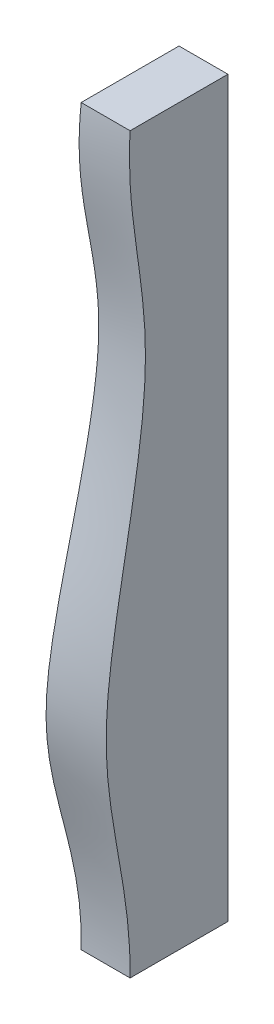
ISO-10303-21;
HEADER;
FILE_DESCRIPTION(('STEP AP214'),'2;1');
FILE_NAME('part.step','',(''),(''),'','','');
FILE_SCHEMA(('AUTOMOTIVE_DESIGN { 1 0 10303 214 1 1 1 1 }'));
ENDSEC;
DATA;
#1=APPLICATION_CONTEXT('core data for automotive mechanical design processes');
#2=APPLICATION_PROTOCOL_DEFINITION('international standard','automotive_design',2000,#1);
#3=PRODUCT_CONTEXT('',#1,'mechanical');
#4=PRODUCT('Part','Part','',(#3));
#5=PRODUCT_RELATED_PRODUCT_CATEGORY('part','',(#4));
#6=PRODUCT_DEFINITION_FORMATION('','',#4);
#7=PRODUCT_DEFINITION_CONTEXT('part definition',#1,'design');
#8=PRODUCT_DEFINITION('design','',#6,#7);
#9=PRODUCT_DEFINITION_SHAPE('','',#8);
#10=(LENGTH_UNIT() NAMED_UNIT(*) SI_UNIT(.MILLI.,.METRE.));
#11=(NAMED_UNIT(*) PLANE_ANGLE_UNIT() SI_UNIT($,.RADIAN.));
#12=(NAMED_UNIT(*) SI_UNIT($,.STERADIAN.) SOLID_ANGLE_UNIT());
#13=UNCERTAINTY_MEASURE_WITH_UNIT(LENGTH_MEASURE(1.E-05),#10,'distance_accuracy_value','');
#14=(GEOMETRIC_REPRESENTATION_CONTEXT(3) GLOBAL_UNCERTAINTY_ASSIGNED_CONTEXT((#13)) GLOBAL_UNIT_ASSIGNED_CONTEXT((#10,
#11,#12)) REPRESENTATION_CONTEXT('',''));
#15=CARTESIAN_POINT('',(0.,0.,0.));
#16=DIRECTION('',(0.,0.,1.));
#17=DIRECTION('',(1.,0.,0.));
#18=AXIS2_PLACEMENT_3D('',#15,#16,#17);
#19=CARTESIAN_POINT('',(650.,375.,253.120113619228));
#20=DIRECTION('',(1.,0.,0.));
#21=DIRECTION('',(0.,0.,-1.));
#22=AXIS2_PLACEMENT_3D('',#19,#20,#21);
#23=PLANE('',#22);
#24=CARTESIAN_POINT('',(650.,375.,100.));
#25=CARTESIAN_POINT('',(650.,373.529887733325,100.089583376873));
#26=CARTESIAN_POINT('',(650.,372.059231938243,100.170200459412));
#27=CARTESIAN_POINT('',(650.,369.117059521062,100.313644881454));
#28=CARTESIAN_POINT('',(650.,367.645542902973,100.376472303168));
#29=CARTESIAN_POINT('',(650.,364.704940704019,100.484368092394));
#30=CARTESIAN_POINT('',(650.,363.235856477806,100.529473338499));
#31=CARTESIAN_POINT('',(650.,360.2972640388,100.602322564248));
#32=CARTESIAN_POINT('',(650.,358.827755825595,100.630066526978));
#33=CARTESIAN_POINT('',(650.,354.423278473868,100.687567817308));
#34=CARTESIAN_POINT('',(650.,351.487937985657,100.691755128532));
#35=CARTESIAN_POINT('',(650.,345.620681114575,100.634585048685));
#36=CARTESIAN_POINT('',(650.,342.688764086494,100.573288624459));
#37=CARTESIAN_POINT('',(650.,336.828206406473,100.388873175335));
#38=CARTESIAN_POINT('',(650.,333.899564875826,100.265781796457));
#39=CARTESIAN_POINT('',(650.,328.045452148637,99.9622336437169));
#40=CARTESIAN_POINT('',(650.,325.11998078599,99.7817800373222));
#41=CARTESIAN_POINT('',(650.,319.263640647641,99.3681176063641));
#42=CARTESIAN_POINT('',(650.,316.332783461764,99.1347461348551));
#43=CARTESIAN_POINT('',(650.,310.474284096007,98.6215532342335));
#44=CARTESIAN_POINT('',(650.,307.546643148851,98.3417178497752));
#45=CARTESIAN_POINT('',(650.,301.694438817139,97.74228273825));
#46=CARTESIAN_POINT('',(650.,298.769876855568,97.4226692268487));
#47=CARTESIAN_POINT('',(650.,292.92362331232,96.7509641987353));
#48=CARTESIAN_POINT('',(650.,290.001932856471,96.3988629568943));
#49=CARTESIAN_POINT('',(650.,284.161156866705,95.6699647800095));
#50=CARTESIAN_POINT('',(650.,281.242071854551,95.2931636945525));
#51=CARTESIAN_POINT('',(650.,275.406197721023,94.5230185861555));
#52=CARTESIAN_POINT('',(650.,272.489408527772,94.1296751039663));
#53=CARTESIAN_POINT('',(650.,266.67410172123,93.3370505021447));
#54=CARTESIAN_POINT('',(650.,263.775577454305,92.937817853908));
#55=CARTESIAN_POINT('',(650.,257.979159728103,92.1394687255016));
#56=CARTESIAN_POINT('',(650.,255.081266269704,91.7403522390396));
#57=CARTESIAN_POINT('',(650.,249.284838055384,90.9503637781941));
#58=CARTESIAN_POINT('',(650.,246.386303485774,90.5594904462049));
#59=CARTESIAN_POINT('',(650.,240.587344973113,89.7939371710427));
#60=CARTESIAN_POINT('',(650.,237.68692122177,89.4192557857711));
#61=CARTESIAN_POINT('',(650.,231.882975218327,88.6937461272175));
#62=CARTESIAN_POINT('',(650.,228.979452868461,88.3429186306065));
#63=CARTESIAN_POINT('',(650.,223.168151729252,87.6723910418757));
#64=CARTESIAN_POINT('',(650.,220.260372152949,87.3526977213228));
#65=CARTESIAN_POINT('',(650.,214.454247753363,86.7527745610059));
#66=CARTESIAN_POINT('',(650.,211.555921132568,86.4723697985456));
#67=CARTESIAN_POINT('',(650.,205.754719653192,85.9554568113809));
#68=CARTESIAN_POINT('',(650.,202.851843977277,85.7189576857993));
#69=CARTESIAN_POINT('',(650.,197.042529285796,85.2955327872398));
#70=CARTESIAN_POINT('',(650.,194.136090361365,85.1086057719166));
#71=CARTESIAN_POINT('',(650.,188.320636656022,84.7892653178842));
#72=CARTESIAN_POINT('',(650.,185.41162236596,84.6568430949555));
#73=CARTESIAN_POINT('',(650.,181.046879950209,84.5022034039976));
#74=CARTESIAN_POINT('',(650.,179.59190635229,84.457991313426));
#75=CARTESIAN_POINT('',(650.,176.681571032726,84.3846652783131));
#76=CARTESIAN_POINT('',(650.,175.226209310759,84.3555513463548));
#77=CARTESIAN_POINT('',(650.,172.315529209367,84.31283446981));
#78=CARTESIAN_POINT('',(650.,170.86021087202,84.2992286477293));
#79=CARTESIAN_POINT('',(650.,167.949510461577,84.2878807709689));
#80=CARTESIAN_POINT('',(650.,166.494128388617,84.2901386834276));
#81=CARTESIAN_POINT('',(650.,164.308571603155,84.3056671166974));
#82=CARTESIAN_POINT('',(650.,163.578349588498,84.3128903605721));
#83=CARTESIAN_POINT('',(650.,162.117957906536,84.331456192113));
#84=CARTESIAN_POINT('',(650.,161.387788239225,84.3427987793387));
#85=CARTESIAN_POINT('',(650.,159.197389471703,84.3828568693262));
#86=CARTESIAN_POINT('',(650.,157.737267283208,84.4176027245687));
#87=CARTESIAN_POINT('',(650.,154.817275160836,84.5021741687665));
#88=CARTESIAN_POINT('',(650.,153.357405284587,84.5520017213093));
#89=CARTESIAN_POINT('',(650.,150.43822333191,84.6658338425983));
#90=CARTESIAN_POINT('',(650.,148.978911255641,84.7298384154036));
#91=CARTESIAN_POINT('',(650.,144.601257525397,84.9418621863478));
#92=CARTESIAN_POINT('',(650.,141.683868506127,85.1098712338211));
#93=CARTESIAN_POINT('',(650.,135.851597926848,85.4931062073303));
#94=CARTESIAN_POINT('',(650.,132.936717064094,85.7083425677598));
#95=CARTESIAN_POINT('',(650.,127.110055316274,86.1807244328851));
#96=CARTESIAN_POINT('',(650.,124.198274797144,86.437874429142));
#97=CARTESIAN_POINT('',(650.,118.378515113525,86.9898248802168));
#98=CARTESIAN_POINT('',(650.,115.470535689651,87.284622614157));
#99=CARTESIAN_POINT('',(650.,109.647268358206,87.9092447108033));
#100=CARTESIAN_POINT('',(650.,106.731994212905,88.2391968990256));
#101=CARTESIAN_POINT('',(650.,100.905713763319,88.9296286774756));
#102=CARTESIAN_POINT('',(650.,97.9947066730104,89.2901016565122));
#103=CARTESIAN_POINT('',(650.,92.176583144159,90.038377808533));
#104=CARTESIAN_POINT('',(650.,89.269466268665,90.4261775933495));
#105=CARTESIAN_POINT('',(650.,83.4587801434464,91.226152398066));
#106=CARTESIAN_POINT('',(650.,80.55521068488,91.6383259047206));
#107=CARTESIAN_POINT('',(650.,74.7513026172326,92.4842869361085));
#108=CARTESIAN_POINT('',(650.,71.8509639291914,92.9180739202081));
#109=CARTESIAN_POINT('',(650.,66.0532253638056,93.8046613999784));
#110=CARTESIAN_POINT('',(650.,63.1558254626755,94.2574617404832));
#111=CARTESIAN_POINT('',(650.,54.5077571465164,95.6342445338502));
#112=CARTESIAN_POINT('',(650.,48.7609601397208,96.5825497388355));
#113=CARTESIAN_POINT('',(650.,37.275086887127,98.5259583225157));
#114=CARTESIAN_POINT('',(650.,31.5360110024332,99.5210638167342));
#115=CARTESIAN_POINT('',(650.,20.0628145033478,101.540469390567));
#116=CARTESIAN_POINT('',(650.,14.3286940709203,102.564770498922));
#117=CARTESIAN_POINT('',(650.,2.86034169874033,104.625342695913));
#118=CARTESIAN_POINT('',(650.,-2.87388943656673,105.661618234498));
#119=CARTESIAN_POINT('',(650.,-11.4760455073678,107.210940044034));
#120=CARTESIAN_POINT('',(650.,-14.3435123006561,107.726522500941));
#121=CARTESIAN_POINT('',(650.,-20.0791832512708,108.753566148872));
#122=CARTESIAN_POINT('',(650.,-22.9473874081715,109.265027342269));
#123=CARTESIAN_POINT('',(650.,-28.6848609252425,110.281284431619));
#124=CARTESIAN_POINT('',(650.,-31.5541302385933,110.786080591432));
#125=CARTESIAN_POINT('',(650.,-37.2942906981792,111.786357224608));
#126=CARTESIAN_POINT('',(650.,-40.165181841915,112.281837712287));
#127=CARTESIAN_POINT('',(650.,-45.9222919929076,113.262903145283));
#128=CARTESIAN_POINT('',(650.,-48.8085205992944,113.748431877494));
#129=CARTESIAN_POINT('',(650.,-54.583527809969,114.704139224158));
#130=CARTESIAN_POINT('',(650.,-57.4723064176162,115.174317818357));
#131=CARTESIAN_POINT('',(650.,-63.252915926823,116.096008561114));
#132=CARTESIAN_POINT('',(650.,-66.1447468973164,116.547520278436));
#133=CARTESIAN_POINT('',(650.,-71.9320052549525,117.42828774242));
#134=CARTESIAN_POINT('',(650.,-74.8274328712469,117.857541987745));
#135=CARTESIAN_POINT('',(650.,-80.622477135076,118.68988810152));
#136=CARTESIAN_POINT('',(650.,-83.5220943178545,119.092976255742));
#137=CARTESIAN_POINT('',(650.,-89.326167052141,119.868717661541));
#138=CARTESIAN_POINT('',(650.,-92.2306236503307,120.241363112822));
#139=CARTESIAN_POINT('',(650.,-98.029737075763,120.949648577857));
#140=CARTESIAN_POINT('',(650.,-100.92437291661,121.285459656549));
#141=CARTESIAN_POINT('',(650.,-106.718288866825,121.917044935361));
#142=CARTESIAN_POINT('',(650.,-109.617569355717,122.212815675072));
#143=CARTESIAN_POINT('',(650.,-115.420074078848,122.758605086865));
#144=CARTESIAN_POINT('',(650.,-118.323297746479,123.008629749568));
#145=CARTESIAN_POINT('',(650.,-124.133069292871,123.456718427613));
#146=CARTESIAN_POINT('',(650.,-127.039616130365,123.654795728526));
#147=CARTESIAN_POINT('',(650.,-131.401591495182,123.907862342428));
#148=CARTESIAN_POINT('',(650.,-132.855761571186,123.984869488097));
#149=CARTESIAN_POINT('',(650.,-135.764850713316,124.123300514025));
#150=CARTESIAN_POINT('',(650.,-137.21976977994,124.184724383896));
#151=CARTESIAN_POINT('',(650.,-140.130053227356,124.29103334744));
#152=CARTESIAN_POINT('',(650.,-141.585417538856,124.335920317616));
#153=CARTESIAN_POINT('',(650.,-143.768782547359,124.390121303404));
#154=CARTESIAN_POINT('',(650.,-144.49662440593,124.406000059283));
#155=CARTESIAN_POINT('',(650.,-145.952392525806,124.433238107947));
#156=CARTESIAN_POINT('',(650.,-146.680318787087,124.444597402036));
#157=CARTESIAN_POINT('',(650.,-148.722769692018,124.470097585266));
#158=CARTESIAN_POINT('',(650.,-150.037362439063,124.479105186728));
#159=CARTESIAN_POINT('',(650.,-152.666558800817,124.482511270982));
#160=CARTESIAN_POINT('',(650.,-153.981162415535,124.476909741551));
#161=CARTESIAN_POINT('',(650.,-157.925284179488,124.438498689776));
#162=CARTESIAN_POINT('',(650.,-160.554622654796,124.384076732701));
#163=CARTESIAN_POINT('',(650.,-165.812021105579,124.219768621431));
#164=CARTESIAN_POINT('',(650.,-168.44008074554,124.109871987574));
#165=CARTESIAN_POINT('',(650.,-173.69376732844,123.837206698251));
#166=CARTESIAN_POINT('',(650.,-176.319393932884,123.674431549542));
#167=CARTESIAN_POINT('',(650.,-181.56704928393,123.299208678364));
#168=CARTESIAN_POINT('',(650.,-184.189078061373,123.086761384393));
#169=CARTESIAN_POINT('',(650.,-189.428412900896,122.615943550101));
#170=CARTESIAN_POINT('',(650.,-192.045719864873,122.357582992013));
#171=CARTESIAN_POINT('',(650.,-197.293175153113,121.797208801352));
#172=CARTESIAN_POINT('',(650.,-199.923293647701,121.494917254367));
#173=CARTESIAN_POINT('',(650.,-205.178415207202,120.852666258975));
#174=CARTESIAN_POINT('',(650.,-207.803419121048,120.512713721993));
#175=CARTESIAN_POINT('',(650.,-213.048967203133,119.800048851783));
#176=CARTESIAN_POINT('',(650.,-215.669511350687,119.427336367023));
#177=CARTESIAN_POINT('',(650.,-220.90683347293,118.654311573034));
#178=CARTESIAN_POINT('',(650.,-223.52361094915,118.25399590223));
#179=CARTESIAN_POINT('',(650.,-228.754122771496,117.431119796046));
#180=CARTESIAN_POINT('',(650.,-231.367856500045,117.008555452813));
#181=CARTESIAN_POINT('',(650.,-236.593024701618,116.146671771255));
#182=CARTESIAN_POINT('',(650.,-239.204458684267,115.70734947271));
#183=CARTESIAN_POINT('',(650.,-245.511338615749,114.632512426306));
#184=CARTESIAN_POINT('',(650.,-249.205827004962,113.991406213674));
#185=CARTESIAN_POINT('',(650.,-256.593667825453,112.702626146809));
#186=CARTESIAN_POINT('',(650.,-260.287020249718,112.054952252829));
#187=CARTESIAN_POINT('',(650.,-267.67459186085,110.768628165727));
#188=CARTESIAN_POINT('',(650.,-271.368810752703,110.129976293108));
#189=CARTESIAN_POINT('',(650.,-278.760019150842,108.876745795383));
#190=CARTESIAN_POINT('',(650.,-282.457007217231,108.262158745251));
#191=CARTESIAN_POINT('',(650.,-289.855525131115,107.071327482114));
#192=CARTESIAN_POINT('',(650.,-293.557052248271,106.495066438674));
#193=CARTESIAN_POINT('',(650.,-300.966254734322,105.394189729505));
#194=CARTESIAN_POINT('',(650.,-304.673926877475,104.869552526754));
#195=CARTESIAN_POINT('',(650.,-312.05732030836,103.88936722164));
#196=CARTESIAN_POINT('',(650.,-315.732949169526,103.433128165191));
#197=CARTESIAN_POINT('',(650.,-323.092706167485,102.593819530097));
#198=CARTESIAN_POINT('',(650.,-326.776834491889,102.210751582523));
#199=CARTESIAN_POINT('',(650.,-334.154883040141,101.527239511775));
#200=CARTESIAN_POINT('',(650.,-337.848807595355,101.226841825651));
#201=CARTESIAN_POINT('',(650.,-345.247748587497,100.716978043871));
#202=CARTESIAN_POINT('',(650.,-348.952773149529,100.50762772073));
#203=CARTESIAN_POINT('',(650.,-354.517379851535,100.267256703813));
#204=CARTESIAN_POINT('',(650.,-356.375424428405,100.199375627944));
#205=CARTESIAN_POINT('',(650.,-360.092276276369,100.089047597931));
#206=CARTESIAN_POINT('',(650.,-361.95108354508,100.046600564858));
#207=CARTESIAN_POINT('',(650.,-365.67490284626,99.9877114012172));
#208=CARTESIAN_POINT('',(650.,-367.539916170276,99.9713506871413));
#209=CARTESIAN_POINT('',(650.,-371.270008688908,99.9654344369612));
#210=CARTESIAN_POINT('',(650.,-373.135087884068,99.9758792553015));
#211=CARTESIAN_POINT('',(650.,-375.,100.));
#212=B_SPLINE_CURVE_WITH_KNOTS('',3,(#24,#25,#26,#27,#28,#29,#30,#31,#32,#33,#34,#35,#36,#37,
#38,#39,#40,#41,#42,#43,#44,#45,#46,#47,#48,#49,#50,#51,#52,#53,#54,#55,#56,#57,#58,#59,#60,#61,
#62,#63,#64,#65,#66,#67,#68,#69,#70,#71,#72,#73,#74,#75,#76,#77,#78,#79,#80,#81,#82,#83,#84,#85,
#86,#87,#88,#89,#90,#91,#92,#93,#94,#95,#96,#97,#98,#99,#100,#101,#102,#103,#104,#105,#106,#107,
#108,#109,#110,#111,#112,#113,#114,#115,#116,#117,#118,#119,#120,#121,#122,#123,#124,#125,#126,
#127,#128,#129,#130,#131,#132,#133,#134,#135,#136,#137,#138,#139,#140,#141,#142,#143,#144,#145,
#146,#147,#148,#149,#150,#151,#152,#153,#154,#155,#156,#157,#158,#159,#160,#161,#162,#163,#164,
#165,#166,#167,#168,#169,#170,#171,#172,#173,#174,#175,#176,#177,#178,#179,#180,#181,#182,#183,
#184,#185,#186,#187,#188,#189,#190,#191,#192,#193,#194,#195,#196,#197,#198,#199,#200,#201,#202,
#203,#204,#205,#206,#207,#208,#209,#210,#211),.UNSPECIFIED.,.F.,.F.,(4,2,2,2,2,2,2,2,2,2,2,2,2,
2,2,2,2,2,2,2,2,2,2,2,2,2,2,2,2,2,2,2,2,2,2,2,2,2,2,2,2,2,2,2,2,2,2,2,2,2,2,2,2,2,2,2,2,2,2,2,2,
2,2,2,2,2,2,2,2,2,2,2,2,2,2,2,2,2,2,2,2,2,2,2,2,2,2,2,2,2,2,2,2,4),(0.,4.41848557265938,
8.83695072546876,13.2461720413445,17.6553976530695,26.4605874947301,35.2575866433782,
44.0506536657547,52.8432352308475,61.6632168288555,70.4858522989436,79.3115536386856,
88.1399055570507,96.9697447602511,105.799295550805,114.576963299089,123.352708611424,
132.126997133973,140.900502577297,149.674293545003,158.449988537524,167.185277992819,
175.922375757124,184.659254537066,193.394724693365,197.76159560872,202.128470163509,
206.494534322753,210.860589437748,213.051352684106,215.242115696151,219.623631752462,
224.005718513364,228.387806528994,237.153993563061,245.922119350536,254.691185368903,
263.459617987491,272.261098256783,281.060676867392,289.85916635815,298.65711016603,
307.454834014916,316.252486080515,333.725710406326,351.199725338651,368.674356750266,
386.155705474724,394.896053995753,403.63639748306,412.376393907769,421.116376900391,
429.896690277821,438.67701523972,447.457542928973,456.238662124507,465.021025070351,
473.805631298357,482.547539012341,491.290201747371,500.031718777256,508.770997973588,
513.139551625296,517.50810818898,521.876168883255,524.060201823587,526.244234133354,
530.188012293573,534.131793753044,542.020828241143,549.911353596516,557.802848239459,
565.694274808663,573.583987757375,581.525980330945,589.466517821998,597.407092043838,
605.348634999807,613.291577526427,621.235929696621,632.485002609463,643.734143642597,
654.98116223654,666.224207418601,677.462282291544,688.695648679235,699.806529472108,
710.917657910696,722.035014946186,733.166467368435,738.744175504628,744.321866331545,
749.916931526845,755.512070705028),.UNSPECIFIED.);
#213=CARTESIAN_POINT('',(650.,375.,100.));
#214=VERTEX_POINT('',#213);
#215=CARTESIAN_POINT('',(650.,-375.,100.));
#216=VERTEX_POINT('',#215);
#217=EDGE_CURVE('E161',#214,#216,#212,.T.);
#218=ORIENTED_EDGE('',*,*,#217,.T.);
#219=DIRECTION('',(0.,0.,-1.));
#220=VECTOR('',#219,1.);
#221=CARTESIAN_POINT('',(650.,-375.,253.120113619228));
#222=LINE('',#221,#220);
#223=CARTESIAN_POINT('',(650.,-375.,0.));
#224=VERTEX_POINT('',#223);
#225=EDGE_CURVE('E162',#216,#224,#222,.T.);
#226=ORIENTED_EDGE('',*,*,#225,.T.);
#227=DIRECTION('',(0.,-1.,0.));
#228=VECTOR('',#227,1.);
#229=CARTESIAN_POINT('',(650.,375.,0.));
#230=LINE('',#229,#228);
#231=CARTESIAN_POINT('',(650.,375.,0.));
#232=VERTEX_POINT('',#231);
#233=EDGE_CURVE('E65',#232,#224,#230,.T.);
#234=ORIENTED_EDGE('',*,*,#233,.F.);
#235=DIRECTION('',(0.,0.,1.));
#236=VECTOR('',#235,1.);
#237=CARTESIAN_POINT('',(650.,375.,253.111113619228));
#238=LINE('',#237,#236);
#239=EDGE_CURVE('E51',#232,#214,#238,.T.);
#240=ORIENTED_EDGE('',*,*,#239,.T.);
#241=EDGE_LOOP('',(#218,#226,#234,#240));
#242=FACE_BOUND('',#241,.T.);
#243=ADVANCED_FACE('F35',(#242),#23,.T.);
#244=CARTESIAN_POINT('',(0.,0.,0.));
#245=DIRECTION('',(0.,0.,-1.));
#246=DIRECTION('',(-1.,0.,0.));
#247=AXIS2_PLACEMENT_3D('',#244,#245,#246);
#248=PLANE('',#247);
#249=DIRECTION('',(1.,0.,0.));
#250=VECTOR('',#249,1.);
#251=CARTESIAN_POINT('',(-750.,-375.,0.));
#252=LINE('',#251,#250);
#253=CARTESIAN_POINT('',(600.,-375.,0.));
#254=VERTEX_POINT('',#253);
#255=EDGE_CURVE('E95',#254,#224,#252,.T.);
#256=ORIENTED_EDGE('',*,*,#255,.F.);
#257=DIRECTION('',(0.,1.,0.));
#258=VECTOR('',#257,1.);
#259=CARTESIAN_POINT('',(600.,375.,0.));
#260=LINE('',#259,#258);
#261=CARTESIAN_POINT('',(600.,375.,0.));
#262=VERTEX_POINT('',#261);
#263=EDGE_CURVE('E82',#254,#262,#260,.T.);
#264=ORIENTED_EDGE('',*,*,#263,.T.);
#265=DIRECTION('',(-1.,0.,0.));
#266=VECTOR('',#265,1.);
#267=CARTESIAN_POINT('',(-750.,375.,0.));
#268=LINE('',#267,#266);
#269=EDGE_CURVE('E100',#232,#262,#268,.T.);
#270=ORIENTED_EDGE('',*,*,#269,.F.);
#271=ORIENTED_EDGE('',*,*,#233,.T.);
#272=EDGE_LOOP('',(#256,#264,#270,#271));
#273=FACE_BOUND('',#272,.T.);
#274=ADVANCED_FACE('F99',(#273),#248,.T.);
#275=CARTESIAN_POINT('',(750.,-375.,100.));
#276=CARTESIAN_POINT('',(750.,-302.078506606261,100.));
#277=CARTESIAN_POINT('',(750.,-224.483786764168,100.));
#278=CARTESIAN_POINT('',(750.,-61.5160152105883,100.));
#279=CARTESIAN_POINT('',(750.,39.4445673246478,100.));
#280=CARTESIAN_POINT('',(750.,211.849847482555,100.));
#281=CARTESIAN_POINT('',(750.,298.882075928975,100.));
#282=CARTESIAN_POINT('',(750.,375.,100.));
#283=CARTESIAN_POINT('',(669.085175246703,-375.,100.));
#284=CARTESIAN_POINT('',(669.085175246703,-302.078506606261,100.));
#285=CARTESIAN_POINT('',(669.085175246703,-234.282472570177,121.198481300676));
#286=CARTESIAN_POINT('',(669.085175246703,-62.2283080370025,120.288550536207));
#287=CARTESIAN_POINT('',(669.085175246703,68.0647781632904,82.7868169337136));
#288=CARTESIAN_POINT('',(669.085175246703,240.312514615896,73.0426687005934));
#289=CARTESIAN_POINT('',(669.085175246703,298.882075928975,100.));
#290=CARTESIAN_POINT('',(669.085175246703,375.,100.));
#291=CARTESIAN_POINT('',(500.445116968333,-375.,100.));
#292=CARTESIAN_POINT('',(517.991528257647,-284.627602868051,95.5040591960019));
#293=CARTESIAN_POINT('',(530.038001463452,-221.673003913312,150.719602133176));
#294=CARTESIAN_POINT('',(473.74510655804,-71.7416270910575,167.060530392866));
#295=CARTESIAN_POINT('',(387.213321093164,45.6135081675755,91.591323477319));
#296=CARTESIAN_POINT('',(378.694107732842,207.638743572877,66.6461848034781));
#297=CARTESIAN_POINT('',(433.17831170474,253.396603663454,122.492891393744));
#298=CARTESIAN_POINT('',(500.445116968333,375.,100.));
#299=CARTESIAN_POINT('',(285.091607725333,-375.,100.));
#300=CARTESIAN_POINT('',(309.270321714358,-264.297524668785,86.4064578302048));
#301=CARTESIAN_POINT('',(325.856840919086,-200.08226970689,164.07204721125));
#302=CARTESIAN_POINT('',(247.47112957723,-80.9425320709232,234.992870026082));
#303=CARTESIAN_POINT('',(127.240382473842,2.40271344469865,186.756001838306));
#304=CARTESIAN_POINT('',(115.567806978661,152.518027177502,151.057444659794));
#305=CARTESIAN_POINT('',(191.428893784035,202.025100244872,189.039851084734));
#306=CARTESIAN_POINT('',(285.091607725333,375.,100.));
#307=CARTESIAN_POINT('',(47.4554331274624,-375.,100.));
#308=CARTESIAN_POINT('',(51.0669239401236,-278.639867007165,99.5141662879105));
#309=CARTESIAN_POINT('',(52.9210710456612,-231.452124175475,201.325948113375));
#310=CARTESIAN_POINT('',(3.18149891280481,-90.8615864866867,272.445475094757));
#311=CARTESIAN_POINT('',(-61.0346058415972,45.7948958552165,186.157760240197));
#312=CARTESIAN_POINT('',(-59.6612105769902,205.286893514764,133.941969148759));
#313=CARTESIAN_POINT('',(-11.8049718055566,220.40073671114,189.8209162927));
#314=CARTESIAN_POINT('',(47.4554331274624,375.,100.));
#315=CARTESIAN_POINT('',(-175.903454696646,-375.,100.));
#316=CARTESIAN_POINT('',(-199.823715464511,-320.588060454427,126.731848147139));
#317=CARTESIAN_POINT('',(-216.967937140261,-300.821135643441,242.921959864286));
#318=CARTESIAN_POINT('',(-184.265304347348,-55.1410097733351,206.147478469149));
#319=CARTESIAN_POINT('',(-119.865061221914,249.096629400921,-32.5779079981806));
#320=CARTESIAN_POINT('',(-104.641938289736,431.262460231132,-94.4845569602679));
#321=CARTESIAN_POINT('',(-136.623034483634,348.137040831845,60.785640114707));
#322=CARTESIAN_POINT('',(-175.903454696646,375.,100.));
#323=CARTESIAN_POINT('',(-355.235514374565,-375.,100.));
#324=CARTESIAN_POINT('',(-319.200833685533,-282.590755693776,58.2859511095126));
#325=CARTESIAN_POINT('',(-293.075279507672,-226.888141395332,104.97090627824));
#326=CARTESIAN_POINT('',(-324.119079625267,-68.6572837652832,122.102733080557));
#327=CARTESIAN_POINT('',(-398.972481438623,73.039345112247,53.3701087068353));
#328=CARTESIAN_POINT('',(-423.398679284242,233.384819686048,47.4380317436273));
#329=CARTESIAN_POINT('',(-392.720188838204,253.575952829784,124.952096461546));
#330=CARTESIAN_POINT('',(-355.235514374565,375.,100.));
#331=CARTESIAN_POINT('',(-536.684515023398,-375.,100.));
#332=CARTESIAN_POINT('',(-494.827225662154,-277.129657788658,52.0422385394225));
#333=CARTESIAN_POINT('',(-464.573647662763,-205.017596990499,67.039018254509));
#334=CARTESIAN_POINT('',(-506.334367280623,-72.2467511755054,96.5036749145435));
#335=CARTESIAN_POINT('',(-600.216684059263,9.35641022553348,95.9941925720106));
#336=CARTESIAN_POINT('',(-628.122542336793,166.946160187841,106.349064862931));
#337=CARTESIAN_POINT('',(-587.011939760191,237.095914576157,138.331902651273));
#338=CARTESIAN_POINT('',(-536.684515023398,375.,100.));
#339=CARTESIAN_POINT('',(-644.685568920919,-375.,100.));
#340=CARTESIAN_POINT('',(-644.685568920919,-302.078506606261,100.));
#341=CARTESIAN_POINT('',(-644.685568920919,-237.237234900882,127.59081546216));
#342=CARTESIAN_POINT('',(-644.685568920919,-62.4430976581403,126.406497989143));
#343=CARTESIAN_POINT('',(-644.685568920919,76.6951111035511,77.5962366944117));
#344=CARTESIAN_POINT('',(-644.685568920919,248.895340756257,64.9137717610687));
#345=CARTESIAN_POINT('',(-644.685568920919,298.882075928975,100.));
#346=CARTESIAN_POINT('',(-644.685568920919,375.,100.));
#347=CARTESIAN_POINT('',(-750.,-375.,100.));
#348=CARTESIAN_POINT('',(-750.,-302.078506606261,100.));
#349=CARTESIAN_POINT('',(-750.,-224.483786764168,100.));
#350=CARTESIAN_POINT('',(-750.,-61.5160152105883,100.));
#351=CARTESIAN_POINT('',(-750.,39.4445673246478,100.));
#352=CARTESIAN_POINT('',(-750.,211.849847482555,100.));
#353=CARTESIAN_POINT('',(-750.,298.882075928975,100.));
#354=CARTESIAN_POINT('',(-750.,375.,100.));
#355=B_SPLINE_SURFACE_WITH_KNOTS('',3,3,((#275,#276,#277,#278,#279,#280,#281,#282),(#283,#284,
#285,#286,#287,#288,#289,#290),(#291,#292,#293,#294,#295,#296,#297,#298),(#299,#300,#301,#302,
#303,#304,#305,#306),(#307,#308,#309,#310,#311,#312,#313,#314),(#315,#316,#317,#318,#319,#320,
#321,#322),(#323,#324,#325,#326,#327,#328,#329,#330),(#331,#332,#333,#334,#335,#336,#337,#338),
(#339,#340,#341,#342,#343,#344,#345,#346),(#347,#348,#349,#350,#351,#352,#353,#354)),
.UNSPECIFIED.,.F.,.F.,.F.,(4,1,1,1,1,1,1,4),(4,1,1,1,1,4),(0.,0.161829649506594,
0.33728011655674,0.430707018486,0.637101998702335,0.783997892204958,0.789371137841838,1.),(0.,
0.291685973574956,0.310378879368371,0.65187108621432,0.695528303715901,1.),.UNSPECIFIED.);
#356=CARTESIAN_POINT('',(600.,-375.,100.));
#357=CARTESIAN_POINT('',(600.,-373.837009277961,99.9695709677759));
#358=CARTESIAN_POINT('',(600.,-372.673849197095,99.9460525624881));
#359=CARTESIAN_POINT('',(600.,-370.347334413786,99.9127881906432));
#360=CARTESIAN_POINT('',(600.,-369.183979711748,99.9030421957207));
#361=CARTESIAN_POINT('',(600.,-365.696578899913,99.8943962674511));
#362=CARTESIAN_POINT('',(600.,-363.37245007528,99.9160168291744));
#363=CARTESIAN_POINT('',(600.,-358.72729565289,100.013299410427));
#364=CARTESIAN_POINT('',(600.,-356.406269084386,100.088916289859));
#365=CARTESIAN_POINT('',(600.,-351.767779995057,100.293065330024));
#366=CARTESIAN_POINT('',(600.,-349.450316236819,100.421569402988));
#367=CARTESIAN_POINT('',(600.,-344.819439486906,100.730092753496));
#368=CARTESIAN_POINT('',(600.,-342.506025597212,100.910098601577));
#369=CARTESIAN_POINT('',(600.,-337.883710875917,101.319932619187));
#370=CARTESIAN_POINT('',(600.,-335.574809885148,101.549758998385));
#371=CARTESIAN_POINT('',(600.,-330.994896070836,102.053611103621));
#372=CARTESIAN_POINT('',(600.,-328.723809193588,102.326965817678));
#373=CARTESIAN_POINT('',(600.,-324.187035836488,102.917899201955));
#374=CARTESIAN_POINT('',(600.,-321.921350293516,103.23548504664));
#375=CARTESIAN_POINT('',(600.,-317.395793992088,103.912335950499));
#376=CARTESIAN_POINT('',(600.,-315.135924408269,104.271608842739));
#377=CARTESIAN_POINT('',(600.,-310.622360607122,105.028974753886));
#378=CARTESIAN_POINT('',(600.,-308.368667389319,105.427073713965));
#379=CARTESIAN_POINT('',(600.,-303.867764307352,106.258917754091));
#380=CARTESIAN_POINT('',(600.,-301.62055478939,106.692664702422));
#381=CARTESIAN_POINT('',(600.,-297.132874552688,107.592318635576));
#382=CARTESIAN_POINT('',(600.,-294.892403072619,108.058221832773));
#383=CARTESIAN_POINT('',(600.,-290.427021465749,109.016547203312));
#384=CARTESIAN_POINT('',(600.,-288.202085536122,109.508849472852));
#385=CARTESIAN_POINT('',(600.,-283.75811845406,110.517825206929));
#386=CARTESIAN_POINT('',(600.,-281.539086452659,111.034494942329));
#387=CARTESIAN_POINT('',(600.,-277.10599133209,112.088175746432));
#388=CARTESIAN_POINT('',(600.,-274.891927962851,112.625185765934));
#389=CARTESIAN_POINT('',(600.,-270.467777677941,113.715289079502));
#390=CARTESIAN_POINT('',(600.,-268.257690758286,114.268382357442));
#391=CARTESIAN_POINT('',(600.,-263.840446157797,115.386172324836));
#392=CARTESIAN_POINT('',(600.,-261.633288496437,115.950869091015));
#393=CARTESIAN_POINT('',(600.,-257.220802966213,117.087174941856));
#394=CARTESIAN_POINT('',(600.,-255.015475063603,117.65878389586));
#395=CARTESIAN_POINT('',(600.,-250.599257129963,118.805648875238));
#396=CARTESIAN_POINT('',(600.,-248.388368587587,119.380910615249));
#397=CARTESIAN_POINT('',(600.,-243.965902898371,120.528410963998));
#398=CARTESIAN_POINT('',(600.,-241.754325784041,121.10064969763));
#399=CARTESIAN_POINT('',(600.,-237.329070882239,122.236891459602));
#400=CARTESIAN_POINT('',(600.,-235.115393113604,122.800894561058));
#401=CARTESIAN_POINT('',(600.,-230.684494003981,123.915329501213));
#402=CARTESIAN_POINT('',(600.,-228.467272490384,124.46576065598));
#403=CARTESIAN_POINT('',(600.,-224.027821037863,125.54762860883));
#404=CARTESIAN_POINT('',(600.,-221.805590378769,126.079062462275));
#405=CARTESIAN_POINT('',(600.,-217.354645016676,127.117466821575));
#406=CARTESIAN_POINT('',(600.,-215.125928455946,127.624429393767));
#407=CARTESIAN_POINT('',(600.,-210.634612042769,128.614136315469));
#408=CARTESIAN_POINT('',(600.,-208.371930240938,129.096510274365));
#409=CARTESIAN_POINT('',(600.,-203.838688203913,130.024661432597));
#410=CARTESIAN_POINT('',(600.,-201.568126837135,130.470433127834));
#411=CARTESIAN_POINT('',(600.,-197.019371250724,131.319675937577));
#412=CARTESIAN_POINT('',(600.,-194.741178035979,131.723152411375));
#413=CARTESIAN_POINT('',(600.,-190.177464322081,132.482449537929));
#414=CARTESIAN_POINT('',(600.,-187.891945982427,132.838283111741));
#415=CARTESIAN_POINT('',(600.,-183.31396469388,133.497382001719));
#416=CARTESIAN_POINT('',(600.,-181.021503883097,133.80066210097));
#417=CARTESIAN_POINT('',(600.,-176.430105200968,134.350271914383));
#418=CARTESIAN_POINT('',(600.,-174.131168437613,134.596610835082));
#419=CARTESIAN_POINT('',(600.,-169.53524724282,135.027810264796));
#420=CARTESIAN_POINT('',(600.,-167.238281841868,135.212872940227));
#421=CARTESIAN_POINT('',(600.,-162.639473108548,135.519568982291));
#422=CARTESIAN_POINT('',(600.,-160.337628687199,135.64118625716));
#423=CARTESIAN_POINT('',(600.,-156.882882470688,135.774122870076));
#424=CARTESIAN_POINT('',(600.,-155.730888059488,135.810187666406));
#425=CARTESIAN_POINT('',(600.,-153.426489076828,135.865537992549));
#426=CARTESIAN_POINT('',(600.,-152.274084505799,135.884823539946));
#427=CARTESIAN_POINT('',(600.,-149.969034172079,135.906420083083));
#428=CARTESIAN_POINT('',(600.,-148.816388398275,135.908729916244));
#429=CARTESIAN_POINT('',(600.,-147.087497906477,135.899352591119));
#430=CARTESIAN_POINT('',(600.,-146.511212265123,135.894086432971));
#431=CARTESIAN_POINT('',(600.,-145.358695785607,135.879281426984));
#432=CARTESIAN_POINT('',(600.,-144.782464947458,135.869742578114));
#433=CARTESIAN_POINT('',(600.,-143.053882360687,135.83489170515));
#434=CARTESIAN_POINT('',(600.,-141.901651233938,135.803345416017));
#435=CARTESIAN_POINT('',(600.,-139.597738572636,135.724458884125));
#436=CARTESIAN_POINT('',(600.,-138.44605703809,135.677118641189));
#437=CARTESIAN_POINT('',(600.,-136.143677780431,135.567470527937));
#438=CARTESIAN_POINT('',(600.,-134.992979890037,135.505166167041));
#439=CARTESIAN_POINT('',(600.,-132.692440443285,135.366364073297));
#440=CARTESIAN_POINT('',(600.,-131.542598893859,135.289866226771));
#441=CARTESIAN_POINT('',(600.,-127.748722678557,135.01518892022));
#442=CARTESIAN_POINT('',(600.,-125.10673579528,134.788170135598));
#443=CARTESIAN_POINT('',(600.,-119.828842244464,134.271625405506));
#444=CARTESIAN_POINT('',(600.,-117.192935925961,133.982095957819));
#445=CARTESIAN_POINT('',(600.,-111.926775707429,133.348163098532));
#446=CARTESIAN_POINT('',(600.,-109.296524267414,133.003739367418));
#447=CARTESIAN_POINT('',(600.,-104.042813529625,132.267071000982));
#448=CARTESIAN_POINT('',(600.,-101.419354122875,131.874827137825));
#449=CARTESIAN_POINT('',(600.,-96.1756748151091,131.04822197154));
#450=CARTESIAN_POINT('',(600.,-93.5554633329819,130.613807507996));
#451=CARTESIAN_POINT('',(600.,-88.3212965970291,129.7088789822));
#452=CARTESIAN_POINT('',(600.,-85.7073413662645,129.238364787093));
#453=CARTESIAN_POINT('',(600.,-80.4820006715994,128.265645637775));
#454=CARTESIAN_POINT('',(600.,-77.8706224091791,127.763402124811));
#455=CARTESIAN_POINT('',(600.,-72.6531524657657,126.732260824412));
#456=CARTESIAN_POINT('',(600.,-70.0470607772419,126.203363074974));
#457=CARTESIAN_POINT('',(600.,-64.8377724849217,125.122597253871));
#458=CARTESIAN_POINT('',(600.,-62.2345791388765,124.570713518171));
#459=CARTESIAN_POINT('',(600.,-57.032290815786,123.447995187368));
#460=CARTESIAN_POINT('',(600.,-54.4331958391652,122.877160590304));
#461=CARTESIAN_POINT('',(600.,-49.238855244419,121.719962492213));
#462=CARTESIAN_POINT('',(600.,-46.6436091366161,121.133601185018));
#463=CARTESIAN_POINT('',(600.,-41.4559906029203,119.948325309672));
#464=CARTESIAN_POINT('',(600.,-38.8636181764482,119.349410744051));
#465=CARTESIAN_POINT('',(600.,-33.6512864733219,118.134880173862));
#466=CARTESIAN_POINT('',(600.,-31.0313535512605,117.519151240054));
#467=CARTESIAN_POINT('',(600.,-25.7932105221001,116.280419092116));
#468=CARTESIAN_POINT('',(600.,-23.1750004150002,115.657415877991));
#469=CARTESIAN_POINT('',(600.,-17.9424129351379,114.407297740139));
#470=CARTESIAN_POINT('',(600.,-15.3280343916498,113.780187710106));
#471=CARTESIAN_POINT('',(600.,-10.0998501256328,112.523583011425));
#472=CARTESIAN_POINT('',(600.,-7.48604440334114,111.894088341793));
#473=CARTESIAN_POINT('',(600.,0.351303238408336,110.006397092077));
#474=CARTESIAN_POINT('',(600.,5.57480290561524,108.748023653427));
#475=CARTESIAN_POINT('',(600.,16.0231046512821,106.248452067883));
#476=CARTESIAN_POINT('',(600.,21.2479046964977,105.007245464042));
#477=CARTESIAN_POINT('',(600.,31.704058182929,102.557916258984));
#478=CARTESIAN_POINT('',(600.,36.9354099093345,101.349786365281));
#479=CARTESIAN_POINT('',(600.,47.4099608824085,98.9825283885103));
#480=CARTESIAN_POINT('',(600.,52.6531615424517,97.8234065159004));
#481=CARTESIAN_POINT('',(600.,60.5050655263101,96.1395887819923));
#482=CARTESIAN_POINT('',(600.,63.108399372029,95.5898394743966));
#483=CARTESIAN_POINT('',(600.,68.3194652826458,94.5087780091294));
#484=CARTESIAN_POINT('',(600.,70.9271981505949,93.9774697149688));
#485=CARTESIAN_POINT('',(600.,76.1472903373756,92.9356716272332));
#486=CARTESIAN_POINT('',(600.,78.7596503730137,92.4251854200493));
#487=CARTESIAN_POINT('',(600.,83.9892565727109,91.4275605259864));
#488=CARTESIAN_POINT('',(600.,86.6065034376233,90.9404255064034));
#489=CARTESIAN_POINT('',(600.,91.8461759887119,89.9922080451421));
#490=CARTESIAN_POINT('',(600.,94.4686024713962,89.5311299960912));
#491=CARTESIAN_POINT('',(600.,99.7189693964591,88.6379490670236));
#492=CARTESIAN_POINT('',(600.,102.346910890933,88.2058523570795));
#493=CARTESIAN_POINT('',(600.,107.593156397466,87.3762819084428));
#494=CARTESIAN_POINT('',(600.,110.211431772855,86.9786275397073));
#495=CARTESIAN_POINT('',(600.,115.453193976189,86.2187076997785));
#496=CARTESIAN_POINT('',(600.,118.076680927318,85.8564430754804));
#497=CARTESIAN_POINT('',(600.,123.328458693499,85.1712338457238));
#498=CARTESIAN_POINT('',(600.,125.95674884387,84.8482841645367));
#499=CARTESIAN_POINT('',(600.,131.217771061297,84.2459631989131));
#500=CARTESIAN_POINT('',(600.,133.850502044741,83.9665825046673));
#501=CARTESIAN_POINT('',(600.,139.12016091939,83.4567930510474));
#502=CARTESIAN_POINT('',(600.,141.757087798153,83.2263738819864));
#503=CARTESIAN_POINT('',(600.,147.035076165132,82.8209037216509));
#504=CARTESIAN_POINT('',(600.,149.676137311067,82.64584836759));
#505=CARTESIAN_POINT('',(600.,153.267735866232,82.4506857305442));
#506=CARTESIAN_POINT('',(600.,154.216824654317,82.4031800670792));
#507=CARTESIAN_POINT('',(600.,156.115392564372,82.3166817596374));
#508=CARTESIAN_POINT('',(600.,157.064871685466,82.2776890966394));
#509=CARTESIAN_POINT('',(600.,158.96420378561,82.2086124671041));
#510=CARTESIAN_POINT('',(600.,159.91405678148,82.1785289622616));
#511=CARTESIAN_POINT('',(600.,161.814014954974,82.1277651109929));
#512=CARTESIAN_POINT('',(600.,162.764120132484,82.1070847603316));
#513=CARTESIAN_POINT('',(600.,164.664481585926,82.0753480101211));
#514=CARTESIAN_POINT('',(600.,165.614737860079,82.0642915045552));
#515=CARTESIAN_POINT('',(600.,167.515310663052,82.0516763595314));
#516=CARTESIAN_POINT('',(600.,168.465627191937,82.0501177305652));
#517=CARTESIAN_POINT('',(600.,171.316497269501,82.059581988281));
#518=CARTESIAN_POINT('',(600.,173.217022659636,82.0847441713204));
#519=CARTESIAN_POINT('',(600.,177.017139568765,82.1718637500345));
#520=CARTESIAN_POINT('',(600.,178.916731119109,82.2338198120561));
#521=CARTESIAN_POINT('',(600.,182.714237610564,82.3933370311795));
#522=CARTESIAN_POINT('',(600.,184.612152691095,82.4908948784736));
#523=CARTESIAN_POINT('',(600.,188.409806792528,82.7203896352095));
#524=CARTESIAN_POINT('',(600.,190.309541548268,82.8523967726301));
#525=CARTESIAN_POINT('',(600.,194.106522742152,83.148948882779));
#526=CARTESIAN_POINT('',(600.,196.003769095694,83.313494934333));
#527=CARTESIAN_POINT('',(600.,199.795509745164,83.67311260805));
#528=CARTESIAN_POINT('',(600.,201.690003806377,83.868186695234));
#529=CARTESIAN_POINT('',(600.,205.476005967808,84.2865823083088));
#530=CARTESIAN_POINT('',(600.,207.367513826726,84.5099060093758));
#531=CARTESIAN_POINT('',(600.,211.147338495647,84.9822654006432));
#532=CARTESIAN_POINT('',(600.,213.03565524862,85.2313015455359));
#533=CARTESIAN_POINT('',(600.,216.808918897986,85.7523056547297));
#534=CARTESIAN_POINT('',(600.,218.693866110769,86.0242713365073));
#535=CARTESIAN_POINT('',(600.,222.706566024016,86.6250121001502));
#536=CARTESIAN_POINT('',(600.,224.833901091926,86.956569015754));
#537=CARTESIAN_POINT('',(600.,229.084889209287,87.6406927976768));
#538=CARTESIAN_POINT('',(600.,231.208542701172,87.9932569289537));
#539=CARTESIAN_POINT('',(600.,235.453026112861,88.7146796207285));
#540=CARTESIAN_POINT('',(600.,237.573856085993,89.0835378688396));
#541=CARTESIAN_POINT('',(600.,241.813580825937,89.8326494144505));
#542=CARTESIAN_POINT('',(600.,243.932475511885,90.2129031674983));
#543=CARTESIAN_POINT('',(600.,248.16924249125,90.9797744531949));
#544=CARTESIAN_POINT('',(600.,250.287114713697,91.36639237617));
#545=CARTESIAN_POINT('',(600.,254.522762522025,92.1408873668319));
#546=CARTESIAN_POINT('',(600.,256.640538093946,92.528764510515));
#547=CARTESIAN_POINT('',(600.,260.870827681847,93.299551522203));
#548=CARTESIAN_POINT('',(600.,262.983339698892,93.6824723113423));
#549=CARTESIAN_POINT('',(600.,267.209925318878,94.439426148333));
#550=CARTESIAN_POINT('',(600.,269.323998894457,94.8134593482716));
#551=CARTESIAN_POINT('',(600.,273.554425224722,95.5477026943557));
#552=CARTESIAN_POINT('',(600.,275.670777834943,95.9079136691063));
#553=CARTESIAN_POINT('',(600.,279.906449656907,96.6097565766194));
#554=CARTESIAN_POINT('',(600.,282.025768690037,96.9513895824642));
#555=CARTESIAN_POINT('',(600.,286.268021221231,97.6115565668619));
#556=CARTESIAN_POINT('',(600.,288.39095472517,97.9300905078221));
#557=CARTESIAN_POINT('',(600.,292.641036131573,98.5398247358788));
#558=CARTESIAN_POINT('',(600.,294.768184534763,98.8310215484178));
#559=CARTESIAN_POINT('',(600.,299.038186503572,99.3835887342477));
#560=CARTESIAN_POINT('',(600.,301.181062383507,99.6447874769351));
#561=CARTESIAN_POINT('',(600.,305.47117566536,100.131906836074));
#562=CARTESIAN_POINT('',(600.,307.61841369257,100.357821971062));
#563=CARTESIAN_POINT('',(600.,311.916591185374,100.771100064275));
#564=CARTESIAN_POINT('',(600.,314.067530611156,100.958463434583));
#565=CARTESIAN_POINT('',(600.,318.372411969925,101.291853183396));
#566=CARTESIAN_POINT('',(600.,320.526353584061,101.437883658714));
#567=CARTESIAN_POINT('',(600.,324.836501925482,101.686319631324));
#568=CARTESIAN_POINT('',(600.,326.992708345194,101.78873043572));
#569=CARTESIAN_POINT('',(600.,331.306610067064,101.948130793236));
#570=CARTESIAN_POINT('',(600.,333.464305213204,102.005124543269));
#571=CARTESIAN_POINT('',(600.,337.81268933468,102.072872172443));
#572=CARTESIAN_POINT('',(600.,340.003389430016,102.08292219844));
#573=CARTESIAN_POINT('',(600.,344.384575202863,102.053960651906));
#574=CARTESIAN_POINT('',(600.,346.575060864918,102.014946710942));
#575=CARTESIAN_POINT('',(600.,350.955103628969,101.887390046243));
#576=CARTESIAN_POINT('',(600.,353.144660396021,101.798835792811));
#577=CARTESIAN_POINT('',(600.,357.522142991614,101.572117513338));
#578=CARTESIAN_POINT('',(600.,359.710067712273,101.43393214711));
#579=CARTESIAN_POINT('',(600.,364.083634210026,101.108205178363));
#580=CARTESIAN_POINT('',(600.,366.269273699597,100.920632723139));
#581=CARTESIAN_POINT('',(600.,369.545033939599,100.602722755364));
#582=CARTESIAN_POINT('',(600.,370.636952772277,100.490607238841));
#583=CARTESIAN_POINT('',(600.,372.819482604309,100.254318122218));
#584=CARTESIAN_POINT('',(600.,373.910093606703,100.130144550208));
#585=CARTESIAN_POINT('',(600.,375.,100.));
#586=B_SPLINE_CURVE_WITH_KNOTS('',3,(#356,#357,#358,#359,#360,#361,#362,#363,#364,#365,#366,
#367,#368,#369,#370,#371,#372,#373,#374,#375,#376,#377,#378,#379,#380,#381,#382,#383,#384,#385,
#386,#387,#388,#389,#390,#391,#392,#393,#394,#395,#396,#397,#398,#399,#400,#401,#402,#403,#404,
#405,#406,#407,#408,#409,#410,#411,#412,#413,#414,#415,#416,#417,#418,#419,#420,#421,#422,#423,
#424,#425,#426,#427,#428,#429,#430,#431,#432,#433,#434,#435,#436,#437,#438,#439,#440,#441,#442,
#443,#444,#445,#446,#447,#448,#449,#450,#451,#452,#453,#454,#455,#456,#457,#458,#459,#460,#461,
#462,#463,#464,#465,#466,#467,#468,#469,#470,#471,#472,#473,#474,#475,#476,#477,#478,#479,#480,
#481,#482,#483,#484,#485,#486,#487,#488,#489,#490,#491,#492,#493,#494,#495,#496,#497,#498,#499,
#500,#501,#502,#503,#504,#505,#506,#507,#508,#509,#510,#511,#512,#513,#514,#515,#516,#517,#518,
#519,#520,#521,#522,#523,#524,#525,#526,#527,#528,#529,#530,#531,#532,#533,#534,#535,#536,#537,
#538,#539,#540,#541,#542,#543,#544,#545,#546,#547,#548,#549,#550,#551,#552,#553,#554,#555,#556,
#557,#558,#559,#560,#561,#562,#563,#564,#565,#566,#567,#568,#569,#570,#571,#572,#573,#574,#575,
#576,#577,#578,#579,#580,#581,#582,#583,#584,#585),.UNSPECIFIED.,.F.,.F.,(4,2,2,2,2,2,2,2,2,2,2,
2,2,2,2,2,2,2,2,2,2,2,2,2,2,2,2,2,2,2,2,2,2,2,2,2,2,2,2,2,2,2,2,2,2,2,2,2,2,2,2,2,2,2,2,2,2,2,2,
2,2,2,2,2,2,2,2,2,2,2,2,2,2,2,2,2,2,2,2,2,2,2,2,2,2,2,2,2,2,2,2,2,2,2,2,2,2,2,2,2,2,2,2,2,2,2,2,
2,2,2,2,2,2,2,4),(0.,3.49012312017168,6.98023905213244,13.9522321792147,20.9184036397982,
27.8808802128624,34.841542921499,41.8019555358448,48.6639366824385,55.527032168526,
62.3914193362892,69.2568585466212,76.1226577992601,82.9876497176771,89.8237397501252,
96.6587869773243,103.493482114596,110.328170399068,117.162903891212,123.9975083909,
130.851018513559,137.704243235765,144.557407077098,151.410915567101,158.265481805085,
165.12225558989,172.062583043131,179.003952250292,185.944440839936,192.883043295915,
199.819690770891,206.755215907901,213.667625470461,220.581787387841,224.039362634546,
227.496934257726,230.954742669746,232.683657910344,234.412573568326,237.870436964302,
241.32830039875,244.785353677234,248.242434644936,256.196647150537,264.151305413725,
272.108915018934,280.06639614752,288.034042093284,296.001717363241,303.97926881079,
311.956808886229,319.93987725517,327.92294645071,335.904893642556,343.886839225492,
351.960766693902,360.034694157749,368.100308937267,376.165927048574,392.284736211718,
408.395299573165,424.502281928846,440.611299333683,448.593483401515,456.577329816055,
464.562545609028,472.549011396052,480.536819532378,488.526322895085,496.471006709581,
504.415880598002,512.359727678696,520.301856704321,528.242295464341,536.182108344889,
539.03291103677,541.88370735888,544.734651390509,547.58559413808,550.436505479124,
553.287419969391,558.989094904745,564.69056318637,570.391501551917,576.104153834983,
581.816995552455,587.530298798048,593.244042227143,598.957886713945,604.671163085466,
611.13008224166,617.588162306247,624.046118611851,630.504333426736,636.962945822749,
643.421955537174,649.862755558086,656.303445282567,662.743748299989,669.183678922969,
675.623620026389,682.064378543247,688.540322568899,695.017271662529,701.494151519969,
707.970389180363,714.445838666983,720.920689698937,727.492316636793,734.064260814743,
740.63773514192,747.214039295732,753.794461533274,757.087382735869,760.380296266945),.UNSPECIFIED.);
#587=CARTESIAN_POINT('',(600.,-375.,100.));
#588=VERTEX_POINT('',#587);
#589=CARTESIAN_POINT('',(600.,375.,100.));
#590=VERTEX_POINT('',#589);
#591=EDGE_CURVE('E11',#588,#590,#586,.T.);
#592=CARTESIAN_POINT('',(-750.,-375.,100.));
#593=CARTESIAN_POINT('',(-644.685568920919,-375.,100.));
#594=CARTESIAN_POINT('',(-536.684515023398,-375.,100.));
#595=CARTESIAN_POINT('',(-355.235514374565,-375.,100.));
#596=CARTESIAN_POINT('',(-175.903454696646,-375.,100.));
#597=CARTESIAN_POINT('',(47.4554331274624,-375.,100.));
#598=CARTESIAN_POINT('',(285.091607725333,-375.,100.));
#599=CARTESIAN_POINT('',(500.445116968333,-375.,100.));
#600=CARTESIAN_POINT('',(669.085175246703,-375.,100.));
#601=CARTESIAN_POINT('',(750.,-375.,100.));
#602=B_SPLINE_CURVE_WITH_KNOTS('',3,(#592,#593,#594,#595,#596,#597,#598,#599,#600,#601),
.UNSPECIFIED.,.F.,.F.,(4,1,1,1,1,1,1,4),(0.,0.210628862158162,0.216002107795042,
0.362898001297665,0.569292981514,0.66271988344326,0.838170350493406,1.),.UNSPECIFIED.);
#603=EDGE_CURVE('E96',#588,#216,#602,.T.);
#604=CARTESIAN_POINT('',(750.,375.,100.));
#605=CARTESIAN_POINT('',(669.085175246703,375.,100.));
#606=CARTESIAN_POINT('',(500.445116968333,375.,100.));
#607=CARTESIAN_POINT('',(285.091607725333,375.,100.));
#608=CARTESIAN_POINT('',(47.4554331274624,375.,100.));
#609=CARTESIAN_POINT('',(-175.903454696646,375.,100.));
#610=CARTESIAN_POINT('',(-355.235514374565,375.,100.));
#611=CARTESIAN_POINT('',(-536.684515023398,375.,100.));
#612=CARTESIAN_POINT('',(-644.685568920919,375.,100.));
#613=CARTESIAN_POINT('',(-750.,375.,100.));
#614=B_SPLINE_CURVE_WITH_KNOTS('',3,(#604,#605,#606,#607,#608,#609,#610,#611,#612,#613),
.UNSPECIFIED.,.F.,.F.,(4,1,1,1,1,1,1,4),(0.,0.161829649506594,0.33728011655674,0.430707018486,
0.637101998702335,0.783997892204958,0.789371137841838,1.),.UNSPECIFIED.);
#615=EDGE_CURVE('E103',#214,#590,#614,.T.);
#616=ORIENTED_EDGE('',*,*,#591,.F.);
#617=ORIENTED_EDGE('',*,*,#603,.T.);
#618=ORIENTED_EDGE('',*,*,#217,.F.);
#619=ORIENTED_EDGE('',*,*,#615,.T.);
#620=EDGE_LOOP('',(#616,#617,#618,#619));
#621=FACE_BOUND('',#620,.T.);
#622=ADVANCED_FACE('F37',(#621),#355,.F.);
#623=CARTESIAN_POINT('',(-750.,375.,253.111113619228));
#624=DIRECTION('',(0.,-1.,0.));
#625=DIRECTION('',(0.,0.,-1.));
#626=AXIS2_PLACEMENT_3D('',#623,#624,#625);
#627=PLANE('',#626);
#628=DIRECTION('',(0.,0.,-1.));
#629=VECTOR('',#628,1.);
#630=CARTESIAN_POINT('',(600.,375.,253.120113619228));
#631=LINE('',#630,#629);
#632=EDGE_CURVE('E85',#590,#262,#631,.T.);
#633=ORIENTED_EDGE('',*,*,#632,.F.);
#634=ORIENTED_EDGE('',*,*,#615,.F.);
#635=ORIENTED_EDGE('',*,*,#239,.F.);
#636=ORIENTED_EDGE('',*,*,#269,.T.);
#637=EDGE_LOOP('',(#633,#634,#635,#636));
#638=FACE_BOUND('',#637,.T.);
#639=ADVANCED_FACE('F141',(#638),#627,.F.);
#640=CARTESIAN_POINT('',(-750.,-375.,253.111113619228));
#641=DIRECTION('',(0.,1.,0.));
#642=DIRECTION('',(0.,0.,1.));
#643=AXIS2_PLACEMENT_3D('',#640,#641,#642);
#644=PLANE('',#643);
#645=DIRECTION('',(0.,0.,-1.));
#646=VECTOR('',#645,1.);
#647=CARTESIAN_POINT('',(600.,-375.,253.120113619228));
#648=LINE('',#647,#646);
#649=EDGE_CURVE('E57',#588,#254,#648,.T.);
#650=ORIENTED_EDGE('',*,*,#649,.T.);
#651=ORIENTED_EDGE('',*,*,#255,.T.);
#652=ORIENTED_EDGE('',*,*,#225,.F.);
#653=ORIENTED_EDGE('',*,*,#603,.F.);
#654=EDGE_LOOP('',(#650,#651,#652,#653));
#655=FACE_BOUND('',#654,.T.);
#656=ADVANCED_FACE('F93',(#655),#644,.F.);
#657=CARTESIAN_POINT('',(600.,375.,253.120113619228));
#658=DIRECTION('',(-1.,0.,0.));
#659=DIRECTION('',(0.,-1.,0.));
#660=AXIS2_PLACEMENT_3D('',#657,#658,#659);
#661=PLANE('',#660);
#662=ORIENTED_EDGE('',*,*,#591,.T.);
#663=ORIENTED_EDGE('',*,*,#632,.T.);
#664=ORIENTED_EDGE('',*,*,#263,.F.);
#665=ORIENTED_EDGE('',*,*,#649,.F.);
#666=EDGE_LOOP('',(#662,#663,#664,#665));
#667=FACE_BOUND('',#666,.T.);
#668=ADVANCED_FACE('F83',(#667),#661,.T.);
#669=CLOSED_SHELL('',(#243,#274,#622,#639,#656,#668));
#670=MANIFOLD_SOLID_BREP('B2',#669);
#671=ADVANCED_BREP_SHAPE_REPRESENTATION('',(#18,#670),#14);
#672=SHAPE_DEFINITION_REPRESENTATION(#9,#671);
ENDSEC;
END-ISO-10303-21;
